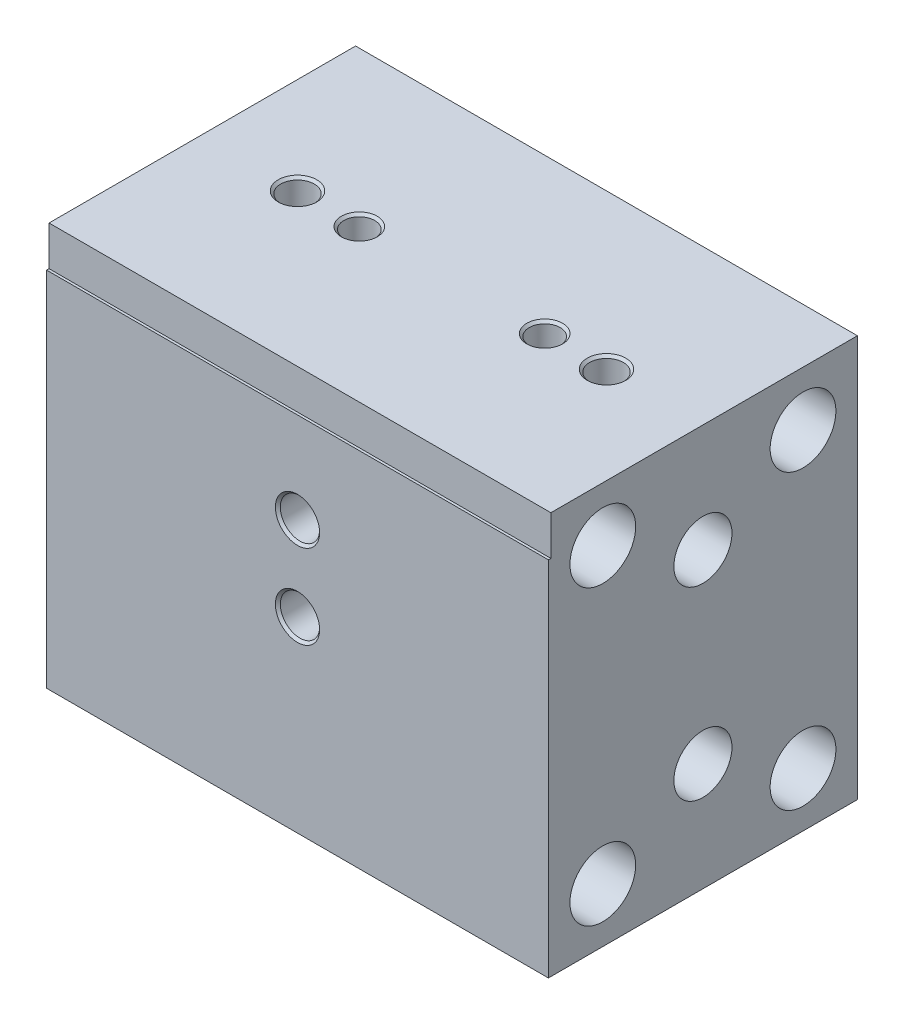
ISO-10303-21;
HEADER;
FILE_DESCRIPTION(('STEP AP214'),'2;1');
FILE_NAME('part.step','',(''),(''),'','','');
FILE_SCHEMA(('AUTOMOTIVE_DESIGN { 1 0 10303 214 1 1 1 1 }'));
ENDSEC;
DATA;
#1=APPLICATION_CONTEXT('core data for automotive mechanical design processes');
#2=APPLICATION_PROTOCOL_DEFINITION('international standard','automotive_design',2000,#1);
#3=PRODUCT_CONTEXT('',#1,'mechanical');
#4=PRODUCT('Part','Part','',(#3));
#5=PRODUCT_RELATED_PRODUCT_CATEGORY('part','',(#4));
#6=PRODUCT_DEFINITION_FORMATION('','',#4);
#7=PRODUCT_DEFINITION_CONTEXT('part definition',#1,'design');
#8=PRODUCT_DEFINITION('design','',#6,#7);
#9=PRODUCT_DEFINITION_SHAPE('','',#8);
#10=(LENGTH_UNIT() NAMED_UNIT(*) SI_UNIT(.MILLI.,.METRE.));
#11=(NAMED_UNIT(*) PLANE_ANGLE_UNIT() SI_UNIT($,.RADIAN.));
#12=(NAMED_UNIT(*) SI_UNIT($,.STERADIAN.) SOLID_ANGLE_UNIT());
#13=UNCERTAINTY_MEASURE_WITH_UNIT(LENGTH_MEASURE(1.E-05),#10,'distance_accuracy_value','');
#14=(GEOMETRIC_REPRESENTATION_CONTEXT(3) GLOBAL_UNCERTAINTY_ASSIGNED_CONTEXT((#13)) GLOBAL_UNIT_ASSIGNED_CONTEXT((#10,
#11,#12)) REPRESENTATION_CONTEXT('',''));
#15=CARTESIAN_POINT('',(0.,0.,0.));
#16=DIRECTION('',(0.,0.,1.));
#17=DIRECTION('',(1.,0.,0.));
#18=AXIS2_PLACEMENT_3D('',#15,#16,#17);
#19=CARTESIAN_POINT('',(-25.781,20.6375,15.875));
#20=DIRECTION('',(1.,0.,0.));
#21=DIRECTION('',(0.,1.,0.));
#22=AXIS2_PLACEMENT_3D('',#19,#20,#21);
#23=PLANE('',#22);
#24=CARTESIAN_POINT('',(-25.781,-9.525,0.));
#25=DIRECTION('',(1.,0.,0.));
#26=DIRECTION('',(0.,0.,-1.));
#27=AXIS2_PLACEMENT_3D('',#24,#25,#26);
#28=CIRCLE('',#27,2.9845);
#29=CARTESIAN_POINT('',(-25.781,-9.525,-2.9845));
#30=VERTEX_POINT('',#29);
#31=EDGE_CURVE('E497',#30,#30,#28,.T.);
#32=ORIENTED_EDGE('',*,*,#31,.T.);
#33=EDGE_LOOP('',(#32));
#34=FACE_BOUND('',#33,.T.);
#35=CARTESIAN_POINT('',(-25.781,9.525,0.));
#36=DIRECTION('',(1.,0.,0.));
#37=DIRECTION('',(0.,0.,-1.));
#38=AXIS2_PLACEMENT_3D('',#35,#36,#37);
#39=CIRCLE('',#38,2.9845);
#40=CARTESIAN_POINT('',(-25.781,9.525,-2.9845));
#41=VERTEX_POINT('',#40);
#42=EDGE_CURVE('E130',#41,#41,#39,.T.);
#43=ORIENTED_EDGE('',*,*,#42,.T.);
#44=EDGE_LOOP('',(#43));
#45=FACE_BOUND('',#44,.T.);
#46=CARTESIAN_POINT('',(-25.781,-15.0495,-10.287));
#47=DIRECTION('',(1.,0.,0.));
#48=DIRECTION('',(0.,0.,-1.));
#49=AXIS2_PLACEMENT_3D('',#46,#47,#48);
#50=CIRCLE('',#49,3.3782);
#51=CARTESIAN_POINT('',(-25.781,-15.0495,-13.6652));
#52=VERTEX_POINT('',#51);
#53=EDGE_CURVE('E155',#52,#52,#50,.T.);
#54=ORIENTED_EDGE('',*,*,#53,.T.);
#55=EDGE_LOOP('',(#54));
#56=FACE_BOUND('',#55,.T.);
#57=CARTESIAN_POINT('',(-25.781,-15.0495,10.287));
#58=DIRECTION('',(1.,0.,0.));
#59=DIRECTION('',(0.,0.,-1.));
#60=AXIS2_PLACEMENT_3D('',#57,#58,#59);
#61=CIRCLE('',#60,3.3782);
#62=CARTESIAN_POINT('',(-25.781,-15.0495,6.9088));
#63=VERTEX_POINT('',#62);
#64=EDGE_CURVE('E392',#63,#63,#61,.T.);
#65=ORIENTED_EDGE('',*,*,#64,.T.);
#66=EDGE_LOOP('',(#65));
#67=FACE_BOUND('',#66,.T.);
#68=CARTESIAN_POINT('',(-25.781,15.0495,-10.287));
#69=DIRECTION('',(1.,0.,0.));
#70=DIRECTION('',(0.,0.,-1.));
#71=AXIS2_PLACEMENT_3D('',#68,#69,#70);
#72=CIRCLE('',#71,3.3782);
#73=CARTESIAN_POINT('',(-25.781,15.0495,-13.6652));
#74=VERTEX_POINT('',#73);
#75=EDGE_CURVE('E387',#74,#74,#72,.T.);
#76=ORIENTED_EDGE('',*,*,#75,.T.);
#77=EDGE_LOOP('',(#76));
#78=FACE_BOUND('',#77,.T.);
#79=CARTESIAN_POINT('',(-25.781,15.0495,10.287));
#80=DIRECTION('',(1.,0.,0.));
#81=DIRECTION('',(0.,0.,-1.));
#82=AXIS2_PLACEMENT_3D('',#79,#80,#81);
#83=CIRCLE('',#82,3.3782);
#84=CARTESIAN_POINT('',(-25.781,15.0495,6.9088));
#85=VERTEX_POINT('',#84);
#86=EDGE_CURVE('E379',#85,#85,#83,.T.);
#87=ORIENTED_EDGE('',*,*,#86,.T.);
#88=EDGE_LOOP('',(#87));
#89=FACE_BOUND('',#88,.T.);
#90=DIRECTION('',(0.,0.,-1.));
#91=VECTOR('',#90,1.);
#92=CARTESIAN_POINT('',(-25.781,16.5735,15.875));
#93=LINE('',#92,#91);
#94=CARTESIAN_POINT('',(-25.781,16.5735,15.875));
#95=VERTEX_POINT('',#94);
#96=CARTESIAN_POINT('',(-25.781,16.5735,15.621));
#97=VERTEX_POINT('',#96);
#98=EDGE_CURVE('E52',#95,#97,#93,.T.);
#99=ORIENTED_EDGE('',*,*,#98,.T.);
#100=DIRECTION('',(0.,1.,0.));
#101=VECTOR('',#100,1.);
#102=CARTESIAN_POINT('',(-25.781,16.5735,15.621));
#103=LINE('',#102,#101);
#104=CARTESIAN_POINT('',(-25.781,20.6375,15.621));
#105=VERTEX_POINT('',#104);
#106=EDGE_CURVE('E87',#97,#105,#103,.T.);
#107=ORIENTED_EDGE('',*,*,#106,.T.);
#108=DIRECTION('',(0.,0.,-1.));
#109=VECTOR('',#108,1.);
#110=CARTESIAN_POINT('',(-25.781,20.6375,15.875));
#111=LINE('',#110,#109);
#112=CARTESIAN_POINT('',(-25.781,20.6375,-15.875));
#113=VERTEX_POINT('',#112);
#114=EDGE_CURVE('E81',#105,#113,#111,.T.);
#115=ORIENTED_EDGE('',*,*,#114,.T.);
#116=DIRECTION('',(0.,-1.,0.));
#117=VECTOR('',#116,1.);
#118=CARTESIAN_POINT('',(-25.781,20.6375,-15.875));
#119=LINE('',#118,#117);
#120=CARTESIAN_POINT('',(-25.781,-20.6375,-15.875));
#121=VERTEX_POINT('',#120);
#122=EDGE_CURVE('E85',#113,#121,#119,.T.);
#123=ORIENTED_EDGE('',*,*,#122,.T.);
#124=DIRECTION('',(0.,0.,-1.));
#125=VECTOR('',#124,1.);
#126=CARTESIAN_POINT('',(-25.781,-20.6375,15.875));
#127=LINE('',#126,#125);
#128=CARTESIAN_POINT('',(-25.781,-20.6375,15.875));
#129=VERTEX_POINT('',#128);
#130=EDGE_CURVE('E119',#129,#121,#127,.T.);
#131=ORIENTED_EDGE('',*,*,#130,.F.);
#132=DIRECTION('',(0.,-1.,0.));
#133=VECTOR('',#132,1.);
#134=CARTESIAN_POINT('',(-25.781,20.6375,15.875));
#135=LINE('',#134,#133);
#136=EDGE_CURVE('E100',#95,#129,#135,.T.);
#137=ORIENTED_EDGE('',*,*,#136,.F.);
#138=EDGE_LOOP('',(#99,#107,#115,#123,#131,#137));
#139=FACE_BOUND('',#138,.T.);
#140=ADVANCED_FACE('F37',(#34,#45,#56,#67,#78,#89,#139),#23,.F.);
#141=CARTESIAN_POINT('',(-25.781,-20.6375,15.875));
#142=DIRECTION('',(0.,1.,0.));
#143=DIRECTION('',(0.,0.,1.));
#144=AXIS2_PLACEMENT_3D('',#141,#142,#143);
#145=PLANE('',#144);
#146=DIRECTION('',(1.,0.,0.));
#147=VECTOR('',#146,1.);
#148=CARTESIAN_POINT('',(-25.781,-20.6375,-15.875));
#149=LINE('',#148,#147);
#150=CARTESIAN_POINT('',(25.781,-20.6375,-15.875));
#151=VERTEX_POINT('',#150);
#152=EDGE_CURVE('E104',#121,#151,#149,.T.);
#153=ORIENTED_EDGE('',*,*,#152,.T.);
#154=DIRECTION('',(0.,0.,-1.));
#155=VECTOR('',#154,1.);
#156=CARTESIAN_POINT('',(25.781,-20.6375,15.875));
#157=LINE('',#156,#155);
#158=CARTESIAN_POINT('',(25.781,-20.6375,15.875));
#159=VERTEX_POINT('',#158);
#160=EDGE_CURVE('E116',#159,#151,#157,.T.);
#161=ORIENTED_EDGE('',*,*,#160,.F.);
#162=DIRECTION('',(1.,0.,0.));
#163=VECTOR('',#162,1.);
#164=CARTESIAN_POINT('',(-25.781,-20.6375,15.875));
#165=LINE('',#164,#163);
#166=EDGE_CURVE('E61',#129,#159,#165,.T.);
#167=ORIENTED_EDGE('',*,*,#166,.F.);
#168=ORIENTED_EDGE('',*,*,#130,.T.);
#169=EDGE_LOOP('',(#153,#161,#167,#168));
#170=FACE_BOUND('',#169,.T.);
#171=ADVANCED_FACE('F182',(#170),#145,.F.);
#172=CARTESIAN_POINT('',(25.781,-20.6375,15.875));
#173=DIRECTION('',(-1.,0.,0.));
#174=DIRECTION('',(0.,0.,1.));
#175=AXIS2_PLACEMENT_3D('',#172,#173,#174);
#176=PLANE('',#175);
#177=CARTESIAN_POINT('',(25.781,-9.525,0.));
#178=DIRECTION('',(1.,0.,0.));
#179=DIRECTION('',(0.,0.,-1.));
#180=AXIS2_PLACEMENT_3D('',#177,#178,#179);
#181=CIRCLE('',#180,2.9845);
#182=CARTESIAN_POINT('',(25.781,-9.525,-2.9845));
#183=VERTEX_POINT('',#182);
#184=EDGE_CURVE('E499',#183,#183,#181,.T.);
#185=ORIENTED_EDGE('',*,*,#184,.F.);
#186=EDGE_LOOP('',(#185));
#187=FACE_BOUND('',#186,.T.);
#188=CARTESIAN_POINT('',(25.781,9.525,0.));
#189=DIRECTION('',(1.,0.,0.));
#190=DIRECTION('',(0.,0.,-1.));
#191=AXIS2_PLACEMENT_3D('',#188,#189,#190);
#192=CIRCLE('',#191,2.9845);
#193=CARTESIAN_POINT('',(25.781,9.525,-2.9845));
#194=VERTEX_POINT('',#193);
#195=EDGE_CURVE('E153',#194,#194,#192,.T.);
#196=ORIENTED_EDGE('',*,*,#195,.F.);
#197=EDGE_LOOP('',(#196));
#198=FACE_BOUND('',#197,.T.);
#199=CARTESIAN_POINT('',(25.781,-15.0495,-10.287));
#200=DIRECTION('',(1.,0.,0.));
#201=DIRECTION('',(0.,0.,-1.));
#202=AXIS2_PLACEMENT_3D('',#199,#200,#201);
#203=CIRCLE('',#202,3.3782);
#204=CARTESIAN_POINT('',(25.781,-15.0495,-13.6652));
#205=VERTEX_POINT('',#204);
#206=EDGE_CURVE('E152',#205,#205,#203,.T.);
#207=ORIENTED_EDGE('',*,*,#206,.F.);
#208=EDGE_LOOP('',(#207));
#209=FACE_BOUND('',#208,.T.);
#210=CARTESIAN_POINT('',(25.781,-15.0495,10.287));
#211=DIRECTION('',(1.,0.,0.));
#212=DIRECTION('',(0.,0.,-1.));
#213=AXIS2_PLACEMENT_3D('',#210,#211,#212);
#214=CIRCLE('',#213,3.3782);
#215=CARTESIAN_POINT('',(25.781,-15.0495,6.9088));
#216=VERTEX_POINT('',#215);
#217=EDGE_CURVE('E395',#216,#216,#214,.T.);
#218=ORIENTED_EDGE('',*,*,#217,.F.);
#219=EDGE_LOOP('',(#218));
#220=FACE_BOUND('',#219,.T.);
#221=CARTESIAN_POINT('',(25.781,15.0495,-10.287));
#222=DIRECTION('',(1.,0.,0.));
#223=DIRECTION('',(0.,0.,-1.));
#224=AXIS2_PLACEMENT_3D('',#221,#222,#223);
#225=CIRCLE('',#224,3.3782);
#226=CARTESIAN_POINT('',(25.781,15.0495,-13.6652));
#227=VERTEX_POINT('',#226);
#228=EDGE_CURVE('E389',#227,#227,#225,.T.);
#229=ORIENTED_EDGE('',*,*,#228,.F.);
#230=EDGE_LOOP('',(#229));
#231=FACE_BOUND('',#230,.T.);
#232=CARTESIAN_POINT('',(25.781,15.0495,10.287));
#233=DIRECTION('',(1.,0.,0.));
#234=DIRECTION('',(0.,0.,-1.));
#235=AXIS2_PLACEMENT_3D('',#232,#233,#234);
#236=CIRCLE('',#235,3.3782);
#237=CARTESIAN_POINT('',(25.781,15.0495,6.9088));
#238=VERTEX_POINT('',#237);
#239=EDGE_CURVE('E383',#238,#238,#236,.T.);
#240=ORIENTED_EDGE('',*,*,#239,.F.);
#241=EDGE_LOOP('',(#240));
#242=FACE_BOUND('',#241,.T.);
#243=DIRECTION('',(0.,0.,-1.));
#244=VECTOR('',#243,1.);
#245=CARTESIAN_POINT('',(25.781,20.6375,15.875));
#246=LINE('',#245,#244);
#247=CARTESIAN_POINT('',(25.781,20.6375,15.621));
#248=VERTEX_POINT('',#247);
#249=CARTESIAN_POINT('',(25.781,20.6375,-15.875));
#250=VERTEX_POINT('',#249);
#251=EDGE_CURVE('E90',#248,#250,#246,.T.);
#252=ORIENTED_EDGE('',*,*,#251,.F.);
#253=DIRECTION('',(0.,1.,0.));
#254=VECTOR('',#253,1.);
#255=CARTESIAN_POINT('',(25.781,16.5735,15.621));
#256=LINE('',#255,#254);
#257=CARTESIAN_POINT('',(25.781,16.5735,15.621));
#258=VERTEX_POINT('',#257);
#259=EDGE_CURVE('E320',#258,#248,#256,.T.);
#260=ORIENTED_EDGE('',*,*,#259,.F.);
#261=DIRECTION('',(0.,0.,-1.));
#262=VECTOR('',#261,1.);
#263=CARTESIAN_POINT('',(25.781,16.5735,15.875));
#264=LINE('',#263,#262);
#265=CARTESIAN_POINT('',(25.781,16.5735,15.875));
#266=VERTEX_POINT('',#265);
#267=EDGE_CURVE('E318',#266,#258,#264,.T.);
#268=ORIENTED_EDGE('',*,*,#267,.F.);
#269=DIRECTION('',(0.,1.,0.));
#270=VECTOR('',#269,1.);
#271=CARTESIAN_POINT('',(25.781,-20.6375,15.875));
#272=LINE('',#271,#270);
#273=EDGE_CURVE('E91',#159,#266,#272,.T.);
#274=ORIENTED_EDGE('',*,*,#273,.F.);
#275=ORIENTED_EDGE('',*,*,#160,.T.);
#276=DIRECTION('',(0.,1.,0.));
#277=VECTOR('',#276,1.);
#278=CARTESIAN_POINT('',(25.781,-20.6375,-15.875));
#279=LINE('',#278,#277);
#280=EDGE_CURVE('E101',#151,#250,#279,.T.);
#281=ORIENTED_EDGE('',*,*,#280,.T.);
#282=EDGE_LOOP('',(#252,#260,#268,#274,#275,#281));
#283=FACE_BOUND('',#282,.T.);
#284=ADVANCED_FACE('F178',(#187,#198,#209,#220,#231,#242,#283),#176,.F.);
#285=CARTESIAN_POINT('',(25.781,20.6375,15.875));
#286=DIRECTION('',(0.,-1.,0.));
#287=DIRECTION('',(1.,0.,0.));
#288=AXIS2_PLACEMENT_3D('',#285,#286,#287);
#289=PLANE('',#288);
#290=CARTESIAN_POINT('',(15.875,20.6375,0.));
#291=DIRECTION('',(0.,-1.,0.));
#292=DIRECTION('',(1.,0.,0.));
#293=AXIS2_PLACEMENT_3D('',#290,#291,#292);
#294=CIRCLE('',#293,1.9812);
#295=CARTESIAN_POINT('',(17.8562,20.6375,0.));
#296=VERTEX_POINT('',#295);
#297=EDGE_CURVE('E237',#296,#296,#294,.T.);
#298=ORIENTED_EDGE('',*,*,#297,.T.);
#299=EDGE_LOOP('',(#298));
#300=FACE_BOUND('',#299,.T.);
#301=CARTESIAN_POINT('',(9.525,20.6375,0.));
#302=DIRECTION('',(0.,-1.,0.));
#303=DIRECTION('',(1.,0.,0.));
#304=AXIS2_PLACEMENT_3D('',#301,#302,#303);
#305=CIRCLE('',#304,1.84150000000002);
#306=CARTESIAN_POINT('',(11.3665,20.6375,0.));
#307=VERTEX_POINT('',#306);
#308=EDGE_CURVE('E242',#307,#307,#305,.T.);
#309=ORIENTED_EDGE('',*,*,#308,.T.);
#310=EDGE_LOOP('',(#309));
#311=FACE_BOUND('',#310,.T.);
#312=CARTESIAN_POINT('',(-9.525,20.6375,0.));
#313=DIRECTION('',(0.,-1.,0.));
#314=DIRECTION('',(1.,0.,0.));
#315=AXIS2_PLACEMENT_3D('',#312,#313,#314);
#316=CIRCLE('',#315,1.84150000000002);
#317=CARTESIAN_POINT('',(-7.68349999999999,20.6375,0.));
#318=VERTEX_POINT('',#317);
#319=EDGE_CURVE('E231',#318,#318,#316,.T.);
#320=ORIENTED_EDGE('',*,*,#319,.T.);
#321=EDGE_LOOP('',(#320));
#322=FACE_BOUND('',#321,.T.);
#323=CARTESIAN_POINT('',(-15.875,20.6375,0.));
#324=DIRECTION('',(0.,-1.,0.));
#325=DIRECTION('',(1.,0.,0.));
#326=AXIS2_PLACEMENT_3D('',#323,#324,#325);
#327=CIRCLE('',#326,1.98119999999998);
#328=CARTESIAN_POINT('',(-13.8938,20.6375,0.));
#329=VERTEX_POINT('',#328);
#330=EDGE_CURVE('E246',#329,#329,#327,.T.);
#331=ORIENTED_EDGE('',*,*,#330,.T.);
#332=EDGE_LOOP('',(#331));
#333=FACE_BOUND('',#332,.T.);
#334=ORIENTED_EDGE('',*,*,#114,.F.);
#335=DIRECTION('',(1.,0.,0.));
#336=VECTOR('',#335,1.);
#337=CARTESIAN_POINT('',(-25.781,20.6375,15.621));
#338=LINE('',#337,#336);
#339=EDGE_CURVE('E106',#105,#248,#338,.T.);
#340=ORIENTED_EDGE('',*,*,#339,.T.);
#341=ORIENTED_EDGE('',*,*,#251,.T.);
#342=DIRECTION('',(-1.,0.,0.));
#343=VECTOR('',#342,1.);
#344=CARTESIAN_POINT('',(25.781,20.6375,-15.875));
#345=LINE('',#344,#343);
#346=EDGE_CURVE('E94',#250,#113,#345,.T.);
#347=ORIENTED_EDGE('',*,*,#346,.T.);
#348=EDGE_LOOP('',(#334,#340,#341,#347));
#349=FACE_BOUND('',#348,.T.);
#350=ADVANCED_FACE('F95',(#300,#311,#322,#333,#349),#289,.F.);
#351=CARTESIAN_POINT('',(-25.781,20.6375,15.875));
#352=DIRECTION('',(0.,0.,-1.));
#353=DIRECTION('',(-1.,0.,0.));
#354=AXIS2_PLACEMENT_3D('',#351,#352,#353);
#355=PLANE('',#354);
#356=CARTESIAN_POINT('',(0.,-1.397,15.875));
#357=DIRECTION('',(0.,0.,-1.));
#358=DIRECTION('',(-1.,0.,0.));
#359=AXIS2_PLACEMENT_3D('',#356,#357,#358);
#360=CIRCLE('',#359,2.27329999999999);
#361=CARTESIAN_POINT('',(-2.27329999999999,-1.397,15.875));
#362=VERTEX_POINT('',#361);
#363=EDGE_CURVE('E255',#362,#362,#360,.T.);
#364=ORIENTED_EDGE('',*,*,#363,.T.);
#365=EDGE_LOOP('',(#364));
#366=FACE_BOUND('',#365,.T.);
#367=CARTESIAN_POINT('',(0.,7.239,15.875));
#368=DIRECTION('',(0.,0.,-1.));
#369=DIRECTION('',(-1.,0.,0.));
#370=AXIS2_PLACEMENT_3D('',#367,#368,#369);
#371=CIRCLE('',#370,2.27329999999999);
#372=CARTESIAN_POINT('',(-2.27329999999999,7.239,15.875));
#373=VERTEX_POINT('',#372);
#374=EDGE_CURVE('E258',#373,#373,#371,.T.);
#375=ORIENTED_EDGE('',*,*,#374,.T.);
#376=EDGE_LOOP('',(#375));
#377=FACE_BOUND('',#376,.T.);
#378=ORIENTED_EDGE('',*,*,#273,.T.);
#379=DIRECTION('',(1.,0.,0.));
#380=VECTOR('',#379,1.);
#381=CARTESIAN_POINT('',(-25.781,16.5735,15.875));
#382=LINE('',#381,#380);
#383=EDGE_CURVE('E322',#95,#266,#382,.T.);
#384=ORIENTED_EDGE('',*,*,#383,.F.);
#385=ORIENTED_EDGE('',*,*,#136,.T.);
#386=ORIENTED_EDGE('',*,*,#166,.T.);
#387=EDGE_LOOP('',(#378,#384,#385,#386));
#388=FACE_BOUND('',#387,.T.);
#389=ADVANCED_FACE('F169',(#366,#377,#388),#355,.F.);
#390=CARTESIAN_POINT('',(-25.781,20.6375,-15.875));
#391=DIRECTION('',(0.,0.,-1.));
#392=DIRECTION('',(-1.,0.,0.));
#393=AXIS2_PLACEMENT_3D('',#390,#391,#392);
#394=PLANE('',#393);
#395=CARTESIAN_POINT('',(-15.875,0.,-15.875));
#396=DIRECTION('',(0.,0.,-1.));
#397=DIRECTION('',(-1.,0.,0.));
#398=AXIS2_PLACEMENT_3D('',#395,#396,#397);
#399=CIRCLE('',#398,1.9812);
#400=CARTESIAN_POINT('',(-17.8562,0.,-15.875));
#401=VERTEX_POINT('',#400);
#402=EDGE_CURVE('E273',#401,#401,#399,.F.);
#403=ORIENTED_EDGE('',*,*,#402,.T.);
#404=EDGE_LOOP('',(#403));
#405=FACE_BOUND('',#404,.T.);
#406=CARTESIAN_POINT('',(-9.525,0.,-15.875));
#407=DIRECTION('',(0.,0.,-1.));
#408=DIRECTION('',(-1.,0.,0.));
#409=AXIS2_PLACEMENT_3D('',#406,#407,#408);
#410=CIRCLE('',#409,1.8415);
#411=CARTESIAN_POINT('',(-11.3665,0.,-15.875));
#412=VERTEX_POINT('',#411);
#413=EDGE_CURVE('E276',#412,#412,#410,.F.);
#414=ORIENTED_EDGE('',*,*,#413,.T.);
#415=EDGE_LOOP('',(#414));
#416=FACE_BOUND('',#415,.T.);
#417=CARTESIAN_POINT('',(9.525,0.,-15.875));
#418=DIRECTION('',(0.,0.,-1.));
#419=DIRECTION('',(-1.,0.,0.));
#420=AXIS2_PLACEMENT_3D('',#417,#418,#419);
#421=CIRCLE('',#420,1.84150000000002);
#422=CARTESIAN_POINT('',(7.68349999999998,0.,-15.875));
#423=VERTEX_POINT('',#422);
#424=EDGE_CURVE('E279',#423,#423,#421,.F.);
#425=ORIENTED_EDGE('',*,*,#424,.T.);
#426=EDGE_LOOP('',(#425));
#427=FACE_BOUND('',#426,.T.);
#428=CARTESIAN_POINT('',(15.875,0.,-15.875));
#429=DIRECTION('',(0.,0.,-1.));
#430=DIRECTION('',(-1.,0.,0.));
#431=AXIS2_PLACEMENT_3D('',#428,#429,#430);
#432=CIRCLE('',#431,1.9812);
#433=CARTESIAN_POINT('',(13.8938,0.,-15.875));
#434=VERTEX_POINT('',#433);
#435=EDGE_CURVE('E281',#434,#434,#432,.F.);
#436=ORIENTED_EDGE('',*,*,#435,.T.);
#437=EDGE_LOOP('',(#436));
#438=FACE_BOUND('',#437,.T.);
#439=ORIENTED_EDGE('',*,*,#122,.F.);
#440=ORIENTED_EDGE('',*,*,#346,.F.);
#441=ORIENTED_EDGE('',*,*,#280,.F.);
#442=ORIENTED_EDGE('',*,*,#152,.F.);
#443=EDGE_LOOP('',(#439,#440,#441,#442));
#444=FACE_BOUND('',#443,.T.);
#445=ADVANCED_FACE('F103',(#405,#416,#427,#438,#444),#394,.T.);
#446=CARTESIAN_POINT('',(-25.781,16.5735,15.621));
#447=DIRECTION('',(0.,0.,-1.));
#448=DIRECTION('',(-1.,0.,0.));
#449=AXIS2_PLACEMENT_3D('',#446,#447,#448);
#450=PLANE('',#449);
#451=ORIENTED_EDGE('',*,*,#259,.T.);
#452=ORIENTED_EDGE('',*,*,#339,.F.);
#453=ORIENTED_EDGE('',*,*,#106,.F.);
#454=DIRECTION('',(1.,0.,0.));
#455=VECTOR('',#454,1.);
#456=CARTESIAN_POINT('',(-25.781,16.5735,15.621));
#457=LINE('',#456,#455);
#458=EDGE_CURVE('E109',#97,#258,#457,.T.);
#459=ORIENTED_EDGE('',*,*,#458,.T.);
#460=EDGE_LOOP('',(#451,#452,#453,#459));
#461=FACE_BOUND('',#460,.T.);
#462=ADVANCED_FACE('F163',(#461),#450,.F.);
#463=CARTESIAN_POINT('',(-25.781,16.5735,15.875));
#464=DIRECTION('',(0.,-1.,0.));
#465=DIRECTION('',(0.,0.,-1.));
#466=AXIS2_PLACEMENT_3D('',#463,#464,#465);
#467=PLANE('',#466);
#468=ORIENTED_EDGE('',*,*,#267,.T.);
#469=ORIENTED_EDGE('',*,*,#458,.F.);
#470=ORIENTED_EDGE('',*,*,#98,.F.);
#471=ORIENTED_EDGE('',*,*,#383,.T.);
#472=EDGE_LOOP('',(#468,#469,#470,#471));
#473=FACE_BOUND('',#472,.T.);
#474=ADVANCED_FACE('F161',(#473),#467,.F.);
#475=CARTESIAN_POINT('',(15.875,20.6375,0.));
#476=DIRECTION('',(0.,1.,0.));
#477=DIRECTION('',(0.,0.,1.));
#478=AXIS2_PLACEMENT_3D('',#475,#476,#477);
#479=CYLINDRICAL_SURFACE('',#478,1.7272);
#480=CARTESIAN_POINT('',(15.875,20.3835,0.));
#481=DIRECTION('',(0.,-1.,0.));
#482=DIRECTION('',(0.,0.,-1.));
#483=AXIS2_PLACEMENT_3D('',#480,#481,#482);
#484=CIRCLE('',#483,1.7272);
#485=CARTESIAN_POINT('',(15.875,20.3835,-1.7272));
#486=VERTEX_POINT('',#485);
#487=EDGE_CURVE('E249',#486,#486,#484,.F.);
#488=ORIENTED_EDGE('',*,*,#487,.T.);
#489=EDGE_LOOP('',(#488));
#490=FACE_BOUND('',#489,.T.);
#491=CARTESIAN_POINT('',(15.875,11.9589310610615,1.7272));
#492=CARTESIAN_POINT('',(15.7873615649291,11.9589320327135,1.7271995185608));
#493=CARTESIAN_POINT('',(15.6997191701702,11.9637357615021,1.72048836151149));
#494=CARTESIAN_POINT('',(15.527332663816,11.982135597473,1.69409867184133));
#495=CARTESIAN_POINT('',(15.4425916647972,11.9957408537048,1.67440664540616));
#496=CARTESIAN_POINT('',(15.278843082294,12.0296011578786,1.62330969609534));
#497=CARTESIAN_POINT('',(15.1998014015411,12.0498118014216,1.5919828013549));
#498=CARTESIAN_POINT('',(15.0481321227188,12.0945267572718,1.51875274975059));
#499=CARTESIAN_POINT('',(14.9755065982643,12.1190324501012,1.47684619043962));
#500=CARTESIAN_POINT('',(14.8297304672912,12.1729262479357,1.37812578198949));
#501=CARTESIAN_POINT('',(14.7574459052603,12.2025532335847,1.32016319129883));
#502=CARTESIAN_POINT('',(14.6229150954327,12.2614351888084,1.19333842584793));
#503=CARTESIAN_POINT('',(14.5606756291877,12.2906898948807,1.1244689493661));
#504=CARTESIAN_POINT('',(14.4419744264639,12.3489424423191,0.969577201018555));
#505=CARTESIAN_POINT('',(14.3866782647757,12.3776336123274,0.882535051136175));
#506=CARTESIAN_POINT('',(14.2919214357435,12.4281966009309,0.698407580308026));
#507=CARTESIAN_POINT('',(14.2524473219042,12.4500742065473,0.601330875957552));
#508=CARTESIAN_POINT('',(14.1942359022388,12.482780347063,0.409148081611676));
#509=CARTESIAN_POINT('',(14.1739492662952,12.4944275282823,0.31465409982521));
#510=CARTESIAN_POINT('',(14.1494813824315,12.5085094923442,0.122955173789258));
#511=CARTESIAN_POINT('',(14.1452863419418,12.5109521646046,0.0257526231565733));
#512=CARTESIAN_POINT('',(14.1527714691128,12.5066255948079,-0.156502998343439));
#513=CARTESIAN_POINT('',(14.1626724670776,12.5008886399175,-0.241661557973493));
#514=CARTESIAN_POINT('',(14.1947326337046,12.482557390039,-0.408860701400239));
#515=CARTESIAN_POINT('',(14.2168927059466,12.4699625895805,-0.490901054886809));
#516=CARTESIAN_POINT('',(14.2727307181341,12.4388885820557,-0.650512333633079));
#517=CARTESIAN_POINT('',(14.3065011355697,12.4203622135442,-0.728041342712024));
#518=CARTESIAN_POINT('',(14.3843361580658,12.3789471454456,-0.876453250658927));
#519=CARTESIAN_POINT('',(14.428403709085,12.356057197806,-0.947334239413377));
#520=CARTESIAN_POINT('',(14.5313081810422,12.3048041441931,-1.08914861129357));
#521=CARTESIAN_POINT('',(14.5912595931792,12.2761143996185,-1.15915478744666));
#522=CARTESIAN_POINT('',(14.7213397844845,12.2178734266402,-1.28869275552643));
#523=CARTESIAN_POINT('',(14.7914812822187,12.1883211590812,-1.34821124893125));
#524=CARTESIAN_POINT('',(14.9486216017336,12.1281496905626,-1.4612877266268));
#525=CARTESIAN_POINT('',(15.0366142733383,12.0977376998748,-1.51358736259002));
#526=CARTESIAN_POINT('',(15.2220726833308,12.0434405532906,-1.6023177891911));
#527=CARTESIAN_POINT('',(15.3195210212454,12.0195437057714,-1.63877707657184));
#528=CARTESIAN_POINT('',(15.4976883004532,11.9868304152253,-1.68738823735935));
#529=CARTESIAN_POINT('',(15.5769938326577,11.9757947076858,-1.70322972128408));
#530=CARTESIAN_POINT('',(15.7377030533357,11.9614919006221,-1.72363336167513));
#531=CARTESIAN_POINT('',(15.8191045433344,11.9582169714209,-1.72820688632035));
#532=CARTESIAN_POINT('',(15.9817063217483,11.9599103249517,-1.72581940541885));
#533=CARTESIAN_POINT('',(16.0629064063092,11.9648849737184,-1.71884949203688));
#534=CARTESIAN_POINT('',(16.2227477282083,11.982359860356,-1.69376739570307));
#535=CARTESIAN_POINT('',(16.3013870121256,11.9948657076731,-1.6756469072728));
#536=CARTESIAN_POINT('',(16.4549963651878,12.0259378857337,-1.6289063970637));
#537=CARTESIAN_POINT('',(16.5299251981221,12.0445598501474,-1.6001896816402));
#538=CARTESIAN_POINT('',(16.6741862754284,12.0858458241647,-1.53324919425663));
#539=CARTESIAN_POINT('',(16.7435162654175,12.1085114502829,-1.49502161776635));
#540=CARTESIAN_POINT('',(16.8870866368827,12.1599784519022,-1.40263103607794));
#541=CARTESIAN_POINT('',(16.960157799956,12.1891678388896,-1.34686373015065));
#542=CARTESIAN_POINT('',(17.0966091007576,12.2475988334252,-1.22446002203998));
#543=CARTESIAN_POINT('',(17.1599807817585,12.2768404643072,-1.15781423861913));
#544=CARTESIAN_POINT('',(17.282016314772,12.3357938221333,-1.00693207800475));
#545=CARTESIAN_POINT('',(17.3394487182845,12.3652203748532,-0.921576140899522));
#546=CARTESIAN_POINT('',(17.4388188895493,12.4177096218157,-0.740493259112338));
#547=CARTESIAN_POINT('',(17.4807685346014,12.4407771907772,-0.644774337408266));
#548=CARTESIAN_POINT('',(17.5443545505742,12.4762925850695,-0.453642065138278));
#549=CARTESIAN_POINT('',(17.5673440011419,12.4894405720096,-0.358813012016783));
#550=CARTESIAN_POINT('',(17.5969801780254,12.5064564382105,-0.165848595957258));
#551=CARTESIAN_POINT('',(17.6036423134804,12.5103330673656,-0.0677164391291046));
#552=CARTESIAN_POINT('',(17.6004360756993,12.5084806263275,0.116268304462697));
#553=CARTESIAN_POINT('',(17.5924662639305,12.5038547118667,0.202173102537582));
#554=CARTESIAN_POINT('',(17.5640192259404,12.487544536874,0.371181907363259));
#555=CARTESIAN_POINT('',(17.5435414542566,12.4758599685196,0.454285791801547));
#556=CARTESIAN_POINT('',(17.4910744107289,12.4465145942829,0.615376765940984));
#557=CARTESIAN_POINT('',(17.4591139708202,12.4288687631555,0.693376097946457));
#558=CARTESIAN_POINT('',(17.3848281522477,12.3890216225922,0.842983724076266));
#559=CARTESIAN_POINT('',(17.3425000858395,12.3668191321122,0.914590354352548));
#560=CARTESIAN_POINT('',(17.2434291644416,12.3168790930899,1.05783642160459));
#561=CARTESIAN_POINT('',(17.1856132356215,12.2888013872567,1.12861420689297));
#562=CARTESIAN_POINT('',(17.0598318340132,12.2314205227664,1.26003254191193));
#563=CARTESIAN_POINT('',(16.9918543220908,12.2021159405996,1.32066088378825));
#564=CARTESIAN_POINT('',(16.8387922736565,12.1417593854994,1.43685443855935));
#565=CARTESIAN_POINT('',(16.7526474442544,12.1108721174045,1.49111998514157));
#566=CARTESIAN_POINT('',(16.5706673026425,12.0549270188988,1.58419465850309));
#567=CARTESIAN_POINT('',(16.4748457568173,12.0298610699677,1.62302536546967));
#568=CARTESIAN_POINT('',(16.2952717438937,11.9937046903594,1.67737632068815));
#569=CARTESIAN_POINT('',(16.2128104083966,11.9808420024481,1.695965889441));
#570=CARTESIAN_POINT('',(16.045231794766,11.9634596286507,1.72087073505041));
#571=CARTESIAN_POINT('',(15.9601177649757,11.9589301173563,1.72720046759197));
#572=CARTESIAN_POINT('',(15.875,11.9589310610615,1.7272));
#573=B_SPLINE_CURVE_WITH_KNOTS('',3,(#491,#492,#493,#494,#495,#496,#497,#498,#499,#500,#501,
#502,#503,#504,#505,#506,#507,#508,#509,#510,#511,#512,#513,#514,#515,#516,#517,#518,#519,#520,
#521,#522,#523,#524,#525,#526,#527,#528,#529,#530,#531,#532,#533,#534,#535,#536,#537,#538,#539,
#540,#541,#542,#543,#544,#545,#546,#547,#548,#549,#550,#551,#552,#553,#554,#555,#556,#557,#558,
#559,#560,#561,#562,#563,#564,#565,#566,#567,#568,#569,#570,#571,#572),.UNSPECIFIED.,.T.,.F.,(4,
2,2,2,2,2,2,2,2,2,2,2,2,2,2,2,2,2,2,2,2,2,2,2,2,2,2,2,2,2,2,2,2,2,2,2,2,2,2,2,4),(0.,
0.262559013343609,0.525391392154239,0.786492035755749,1.04767675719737,1.33834284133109,
1.62920434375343,1.94859630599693,2.26771625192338,2.55805080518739,2.84813644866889,
3.10468711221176,3.36125668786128,3.61991911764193,3.87865564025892,4.1670804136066,
4.4558683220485,4.77460669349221,5.0927692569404,5.33656772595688,5.58012012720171,
5.82386056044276,6.06778276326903,6.31398821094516,6.56029230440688,6.8484726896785,
7.13690291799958,7.4562294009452,7.77531040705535,8.06894708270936,8.36230652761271,
8.6202498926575,8.87820450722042,9.13551589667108,9.39289406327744,9.67856450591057,
9.9645761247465,10.2821905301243,10.5993592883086,10.8546677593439,11.1096750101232),.UNSPECIFIED.);
#574=CARTESIAN_POINT('',(15.875,11.9589310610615,1.7272));
#575=VERTEX_POINT('',#574);
#576=EDGE_CURVE('E129',#575,#575,#573,.T.);
#577=ORIENTED_EDGE('',*,*,#576,.T.);
#578=EDGE_LOOP('',(#577));
#579=FACE_BOUND('',#578,.T.);
#580=ADVANCED_FACE('F157',(#490,#579),#479,.F.);
#581=CARTESIAN_POINT('',(-15.875,20.6375,0.));
#582=DIRECTION('',(0.,1.,0.));
#583=DIRECTION('',(0.,0.,1.));
#584=AXIS2_PLACEMENT_3D('',#581,#582,#583);
#585=CYLINDRICAL_SURFACE('',#584,1.7272);
#586=CARTESIAN_POINT('',(-15.875,20.3835,0.));
#587=DIRECTION('',(0.,-1.,0.));
#588=DIRECTION('',(0.,0.,-1.));
#589=AXIS2_PLACEMENT_3D('',#586,#587,#588);
#590=CIRCLE('',#589,1.7272);
#591=CARTESIAN_POINT('',(-15.875,20.3835,-1.7272));
#592=VERTEX_POINT('',#591);
#593=EDGE_CURVE('E11',#592,#592,#590,.F.);
#594=ORIENTED_EDGE('',*,*,#593,.T.);
#595=EDGE_LOOP('',(#594));
#596=FACE_BOUND('',#595,.T.);
#597=CARTESIAN_POINT('',(-15.875,11.9589310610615,1.7272));
#598=CARTESIAN_POINT('',(-15.9626384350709,11.9589320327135,1.7271995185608));
#599=CARTESIAN_POINT('',(-16.0502808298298,11.9637357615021,1.72048836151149));
#600=CARTESIAN_POINT('',(-16.222667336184,11.982135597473,1.69409867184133));
#601=CARTESIAN_POINT('',(-16.3074083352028,11.9957408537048,1.67440664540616));
#602=CARTESIAN_POINT('',(-16.471156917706,12.0296011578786,1.62330969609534));
#603=CARTESIAN_POINT('',(-16.5501985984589,12.0498118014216,1.5919828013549));
#604=CARTESIAN_POINT('',(-16.7018678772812,12.0945267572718,1.51875274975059));
#605=CARTESIAN_POINT('',(-16.7744934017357,12.1190324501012,1.47684619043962));
#606=CARTESIAN_POINT('',(-16.9202695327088,12.1729262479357,1.37812578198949));
#607=CARTESIAN_POINT('',(-16.9925540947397,12.2025532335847,1.32016319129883));
#608=CARTESIAN_POINT('',(-17.1270849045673,12.2614351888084,1.19333842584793));
#609=CARTESIAN_POINT('',(-17.1893243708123,12.2906898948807,1.1244689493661));
#610=CARTESIAN_POINT('',(-17.3080255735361,12.3489424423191,0.969577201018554));
#611=CARTESIAN_POINT('',(-17.3633217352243,12.3776336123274,0.882535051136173));
#612=CARTESIAN_POINT('',(-17.4580785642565,12.4281966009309,0.698407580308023));
#613=CARTESIAN_POINT('',(-17.4975526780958,12.4500742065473,0.601330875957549));
#614=CARTESIAN_POINT('',(-17.5557640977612,12.482780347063,0.409148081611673));
#615=CARTESIAN_POINT('',(-17.5760507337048,12.4944275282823,0.314654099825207));
#616=CARTESIAN_POINT('',(-17.6005186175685,12.5085094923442,0.122955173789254));
#617=CARTESIAN_POINT('',(-17.6047136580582,12.5109521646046,0.02575262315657));
#618=CARTESIAN_POINT('',(-17.5972285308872,12.5066255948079,-0.156502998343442));
#619=CARTESIAN_POINT('',(-17.5873275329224,12.5008886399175,-0.241661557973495));
#620=CARTESIAN_POINT('',(-17.5552673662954,12.482557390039,-0.408860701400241));
#621=CARTESIAN_POINT('',(-17.5331072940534,12.4699625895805,-0.490901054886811));
#622=CARTESIAN_POINT('',(-17.4772692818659,12.4388885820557,-0.650512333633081));
#623=CARTESIAN_POINT('',(-17.4434988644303,12.4203622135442,-0.728041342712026));
#624=CARTESIAN_POINT('',(-17.3656638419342,12.3789471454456,-0.876453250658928));
#625=CARTESIAN_POINT('',(-17.321596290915,12.356057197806,-0.947334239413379));
#626=CARTESIAN_POINT('',(-17.2186918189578,12.3048041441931,-1.08914861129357));
#627=CARTESIAN_POINT('',(-17.1587404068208,12.2761143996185,-1.15915478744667));
#628=CARTESIAN_POINT('',(-17.0286602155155,12.2178734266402,-1.28869275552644));
#629=CARTESIAN_POINT('',(-16.9585187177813,12.1883211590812,-1.34821124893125));
#630=CARTESIAN_POINT('',(-16.8013783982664,12.1281496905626,-1.4612877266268));
#631=CARTESIAN_POINT('',(-16.7133857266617,12.0977376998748,-1.51358736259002));
#632=CARTESIAN_POINT('',(-16.5279273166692,12.0434405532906,-1.60231778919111));
#633=CARTESIAN_POINT('',(-16.4304789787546,12.0195437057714,-1.63877707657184));
#634=CARTESIAN_POINT('',(-16.2523116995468,11.9868304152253,-1.68738823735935));
#635=CARTESIAN_POINT('',(-16.1730061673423,11.9757947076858,-1.70322972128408));
#636=CARTESIAN_POINT('',(-16.0122969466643,11.9614919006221,-1.72363336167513));
#637=CARTESIAN_POINT('',(-15.9308954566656,11.9582169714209,-1.72820688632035));
#638=CARTESIAN_POINT('',(-15.7682936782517,11.9599103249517,-1.72581940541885));
#639=CARTESIAN_POINT('',(-15.6870935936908,11.9648849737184,-1.71884949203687));
#640=CARTESIAN_POINT('',(-15.5272522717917,11.982359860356,-1.69376739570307));
#641=CARTESIAN_POINT('',(-15.4486129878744,11.9948657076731,-1.6756469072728));
#642=CARTESIAN_POINT('',(-15.2950036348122,12.0259378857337,-1.62890639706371));
#643=CARTESIAN_POINT('',(-15.2200748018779,12.0445598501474,-1.6001896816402));
#644=CARTESIAN_POINT('',(-15.0758137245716,12.0858458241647,-1.53324919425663));
#645=CARTESIAN_POINT('',(-15.0064837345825,12.1085114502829,-1.49502161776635));
#646=CARTESIAN_POINT('',(-14.8629133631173,12.1599784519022,-1.40263103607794));
#647=CARTESIAN_POINT('',(-14.789842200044,12.1891678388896,-1.34686373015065));
#648=CARTESIAN_POINT('',(-14.6533908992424,12.2475988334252,-1.22446002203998));
#649=CARTESIAN_POINT('',(-14.5900192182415,12.2768404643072,-1.15781423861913));
#650=CARTESIAN_POINT('',(-14.467983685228,12.3357938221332,-1.00693207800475));
#651=CARTESIAN_POINT('',(-14.4105512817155,12.3652203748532,-0.921576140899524));
#652=CARTESIAN_POINT('',(-14.3111811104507,12.4177096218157,-0.740493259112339));
#653=CARTESIAN_POINT('',(-14.2692314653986,12.4407771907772,-0.644774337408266));
#654=CARTESIAN_POINT('',(-14.2056454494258,12.4762925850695,-0.453642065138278));
#655=CARTESIAN_POINT('',(-14.1826559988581,12.4894405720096,-0.358813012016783));
#656=CARTESIAN_POINT('',(-14.1530198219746,12.5064564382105,-0.165848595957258));
#657=CARTESIAN_POINT('',(-14.1463576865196,12.5103330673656,-0.0677164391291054));
#658=CARTESIAN_POINT('',(-14.1495639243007,12.5084806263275,0.116268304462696));
#659=CARTESIAN_POINT('',(-14.1575337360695,12.5038547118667,0.20217310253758));
#660=CARTESIAN_POINT('',(-14.1859807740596,12.487544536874,0.371181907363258));
#661=CARTESIAN_POINT('',(-14.2064585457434,12.4758599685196,0.454285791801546));
#662=CARTESIAN_POINT('',(-14.2589255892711,12.4465145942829,0.615376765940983));
#663=CARTESIAN_POINT('',(-14.2908860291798,12.4288687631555,0.693376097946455));
#664=CARTESIAN_POINT('',(-14.3651718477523,12.3890216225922,0.842983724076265));
#665=CARTESIAN_POINT('',(-14.4074999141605,12.3668191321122,0.914590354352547));
#666=CARTESIAN_POINT('',(-14.5065708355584,12.3168790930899,1.05783642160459));
#667=CARTESIAN_POINT('',(-14.5643867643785,12.2888013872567,1.12861420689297));
#668=CARTESIAN_POINT('',(-14.6901681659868,12.2314205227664,1.26003254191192));
#669=CARTESIAN_POINT('',(-14.7581456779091,12.2021159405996,1.32066088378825));
#670=CARTESIAN_POINT('',(-14.9112077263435,12.1417593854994,1.43685443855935));
#671=CARTESIAN_POINT('',(-14.9973525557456,12.1108721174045,1.49111998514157));
#672=CARTESIAN_POINT('',(-15.1793326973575,12.0549270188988,1.58419465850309));
#673=CARTESIAN_POINT('',(-15.2751542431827,12.0298610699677,1.62302536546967));
#674=CARTESIAN_POINT('',(-15.4547282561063,11.9937046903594,1.67737632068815));
#675=CARTESIAN_POINT('',(-15.5371895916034,11.9808420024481,1.695965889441));
#676=CARTESIAN_POINT('',(-15.704768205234,11.9634596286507,1.72087073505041));
#677=CARTESIAN_POINT('',(-15.7898822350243,11.9589301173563,1.72720046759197));
#678=CARTESIAN_POINT('',(-15.875,11.9589310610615,1.7272));
#679=B_SPLINE_CURVE_WITH_KNOTS('',3,(#597,#598,#599,#600,#601,#602,#603,#604,#605,#606,#607,
#608,#609,#610,#611,#612,#613,#614,#615,#616,#617,#618,#619,#620,#621,#622,#623,#624,#625,#626,
#627,#628,#629,#630,#631,#632,#633,#634,#635,#636,#637,#638,#639,#640,#641,#642,#643,#644,#645,
#646,#647,#648,#649,#650,#651,#652,#653,#654,#655,#656,#657,#658,#659,#660,#661,#662,#663,#664,
#665,#666,#667,#668,#669,#670,#671,#672,#673,#674,#675,#676,#677,#678),.UNSPECIFIED.,.T.,.F.,(4,
2,2,2,2,2,2,2,2,2,2,2,2,2,2,2,2,2,2,2,2,2,2,2,2,2,2,2,2,2,2,2,2,2,2,2,2,2,2,2,4),(0.,
0.262559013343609,0.525391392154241,0.786492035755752,1.04767675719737,1.33834284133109,
1.62920434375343,1.94859630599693,2.26771625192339,2.55805080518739,2.84813644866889,
3.10468711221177,3.36125668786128,3.61991911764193,3.87865564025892,4.1670804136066,
4.45586832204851,4.77460669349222,5.0927692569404,5.33656772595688,5.58012012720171,
5.82386056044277,6.06778276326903,6.31398821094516,6.56029230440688,6.8484726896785,
7.13690291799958,7.4562294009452,7.77531040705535,8.06894708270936,8.36230652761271,
8.6202498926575,8.87820450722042,9.13551589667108,9.39289406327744,9.67856450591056,
9.9645761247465,10.2821905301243,10.5993592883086,10.8546677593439,11.1096750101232),.UNSPECIFIED.);
#680=CARTESIAN_POINT('',(-15.875,11.9589310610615,1.7272));
#681=VERTEX_POINT('',#680);
#682=EDGE_CURVE('E122',#681,#681,#679,.T.);
#683=ORIENTED_EDGE('',*,*,#682,.T.);
#684=EDGE_LOOP('',(#683));
#685=FACE_BOUND('',#684,.T.);
#686=ADVANCED_FACE('F132',(#596,#685),#585,.F.);
#687=CARTESIAN_POINT('',(9.525,14.2875,0.));
#688=DIRECTION('',(0.,1.,0.));
#689=DIRECTION('',(0.,0.,1.));
#690=AXIS2_PLACEMENT_3D('',#687,#688,#689);
#691=CONICAL_SURFACE('',#690,1.5875,1.02974425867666);
#692=CARTESIAN_POINT('',(9.525,13.3336337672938,0.));
#693=VERTEX_POINT('',#692);
#694=VERTEX_LOOP('',#693);
#695=FACE_BOUND('',#694,.T.);
#696=CARTESIAN_POINT('',(9.525,14.2875,0.));
#697=DIRECTION('',(0.,1.,0.));
#698=DIRECTION('',(0.,0.,1.));
#699=AXIS2_PLACEMENT_3D('',#696,#697,#698);
#700=CIRCLE('',#699,1.5875);
#701=CARTESIAN_POINT('',(9.525,14.2875,1.5875));
#702=VERTEX_POINT('',#701);
#703=EDGE_CURVE('E315',#702,#702,#700,.T.);
#704=ORIENTED_EDGE('',*,*,#703,.T.);
#705=EDGE_LOOP('',(#704));
#706=FACE_BOUND('',#705,.T.);
#707=ADVANCED_FACE('F471',(#695,#706),#691,.F.);
#708=CARTESIAN_POINT('',(9.525,20.6375,0.));
#709=DIRECTION('',(0.,1.,0.));
#710=DIRECTION('',(0.,0.,1.));
#711=AXIS2_PLACEMENT_3D('',#708,#709,#710);
#712=CYLINDRICAL_SURFACE('',#711,1.5875);
#713=CARTESIAN_POINT('',(9.525,20.3835,0.));
#714=DIRECTION('',(0.,-1.,0.));
#715=DIRECTION('',(0.,0.,-1.));
#716=AXIS2_PLACEMENT_3D('',#713,#714,#715);
#717=CIRCLE('',#716,1.5875);
#718=CARTESIAN_POINT('',(9.525,20.3835,-1.5875));
#719=VERTEX_POINT('',#718);
#720=EDGE_CURVE('E235',#719,#719,#717,.F.);
#721=ORIENTED_EDGE('',*,*,#720,.T.);
#722=EDGE_LOOP('',(#721));
#723=FACE_BOUND('',#722,.T.);
#724=ORIENTED_EDGE('',*,*,#703,.F.);
#725=EDGE_LOOP('',(#724));
#726=FACE_BOUND('',#725,.T.);
#727=ADVANCED_FACE('F468',(#723,#726),#712,.F.);
#728=CARTESIAN_POINT('',(-9.525,14.2875,0.));
#729=DIRECTION('',(0.,1.,0.));
#730=DIRECTION('',(0.,0.,1.));
#731=AXIS2_PLACEMENT_3D('',#728,#729,#730);
#732=CONICAL_SURFACE('',#731,1.5875,1.02974425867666);
#733=CARTESIAN_POINT('',(-9.525,13.3336337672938,0.));
#734=VERTEX_POINT('',#733);
#735=VERTEX_LOOP('',#734);
#736=FACE_BOUND('',#735,.T.);
#737=CARTESIAN_POINT('',(-9.525,14.2875,0.));
#738=DIRECTION('',(0.,1.,0.));
#739=DIRECTION('',(0.,0.,1.));
#740=AXIS2_PLACEMENT_3D('',#737,#738,#739);
#741=CIRCLE('',#740,1.5875);
#742=CARTESIAN_POINT('',(-9.525,14.2875,1.5875));
#743=VERTEX_POINT('',#742);
#744=EDGE_CURVE('E312',#743,#743,#741,.T.);
#745=ORIENTED_EDGE('',*,*,#744,.T.);
#746=EDGE_LOOP('',(#745));
#747=FACE_BOUND('',#746,.T.);
#748=ADVANCED_FACE('F465',(#736,#747),#732,.F.);
#749=CARTESIAN_POINT('',(-9.525,20.6375,0.));
#750=DIRECTION('',(0.,1.,0.));
#751=DIRECTION('',(0.,0.,1.));
#752=AXIS2_PLACEMENT_3D('',#749,#750,#751);
#753=CYLINDRICAL_SURFACE('',#752,1.5875);
#754=CARTESIAN_POINT('',(-9.525,20.3835,0.));
#755=DIRECTION('',(0.,-1.,0.));
#756=DIRECTION('',(0.,0.,-1.));
#757=AXIS2_PLACEMENT_3D('',#754,#755,#756);
#758=CIRCLE('',#757,1.5875);
#759=CARTESIAN_POINT('',(-9.525,20.3835,-1.5875));
#760=VERTEX_POINT('',#759);
#761=EDGE_CURVE('E45',#760,#760,#758,.F.);
#762=ORIENTED_EDGE('',*,*,#761,.T.);
#763=EDGE_LOOP('',(#762));
#764=FACE_BOUND('',#763,.T.);
#765=ORIENTED_EDGE('',*,*,#744,.F.);
#766=EDGE_LOOP('',(#765));
#767=FACE_BOUND('',#766,.T.);
#768=ADVANCED_FACE('F461',(#764,#767),#753,.F.);
#769=CARTESIAN_POINT('',(0.,-1.397,6.3246));
#770=DIRECTION('',(0.,0.,1.));
#771=DIRECTION('',(1.,0.,0.));
#772=AXIS2_PLACEMENT_3D('',#769,#770,#771);
#773=CONICAL_SURFACE('',#772,2.0193,1.02974425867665);
#774=CARTESIAN_POINT('',(0.,-1.397,5.11128215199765));
#775=VERTEX_POINT('',#774);
#776=VERTEX_LOOP('',#775);
#777=FACE_BOUND('',#776,.T.);
#778=CARTESIAN_POINT('',(0.,-1.397,6.3246));
#779=DIRECTION('',(0.,0.,1.));
#780=DIRECTION('',(1.,0.,0.));
#781=AXIS2_PLACEMENT_3D('',#778,#779,#780);
#782=CIRCLE('',#781,2.0193);
#783=CARTESIAN_POINT('',(2.0193,-1.397,6.3246));
#784=VERTEX_POINT('',#783);
#785=EDGE_CURVE('E303',#784,#784,#782,.T.);
#786=ORIENTED_EDGE('',*,*,#785,.T.);
#787=EDGE_LOOP('',(#786));
#788=FACE_BOUND('',#787,.T.);
#789=ADVANCED_FACE('F457',(#777,#788),#773,.F.);
#790=CARTESIAN_POINT('',(0.,-1.397,15.875));
#791=DIRECTION('',(0.,0.,1.));
#792=DIRECTION('',(1.,0.,0.));
#793=AXIS2_PLACEMENT_3D('',#790,#791,#792);
#794=CYLINDRICAL_SURFACE('',#793,2.0193);
#795=CARTESIAN_POINT('',(0.,-1.397,15.621));
#796=DIRECTION('',(0.,0.,-1.));
#797=DIRECTION('',(-1.,0.,0.));
#798=AXIS2_PLACEMENT_3D('',#795,#796,#797);
#799=CIRCLE('',#798,2.0193);
#800=CARTESIAN_POINT('',(-2.01929999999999,-1.397,15.621));
#801=VERTEX_POINT('',#800);
#802=EDGE_CURVE('E261',#801,#801,#799,.F.);
#803=ORIENTED_EDGE('',*,*,#802,.T.);
#804=EDGE_LOOP('',(#803));
#805=FACE_BOUND('',#804,.T.);
#806=ORIENTED_EDGE('',*,*,#785,.F.);
#807=EDGE_LOOP('',(#806));
#808=FACE_BOUND('',#807,.T.);
#809=ADVANCED_FACE('F453',(#805,#808),#794,.F.);
#810=CARTESIAN_POINT('',(0.,7.239,6.3246));
#811=DIRECTION('',(0.,0.,1.));
#812=DIRECTION('',(1.,0.,0.));
#813=AXIS2_PLACEMENT_3D('',#810,#811,#812);
#814=CONICAL_SURFACE('',#813,2.0193,1.02974425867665);
#815=CARTESIAN_POINT('',(0.,7.239,5.11128215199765));
#816=VERTEX_POINT('',#815);
#817=VERTEX_LOOP('',#816);
#818=FACE_BOUND('',#817,.T.);
#819=CARTESIAN_POINT('',(0.,7.239,6.3246));
#820=DIRECTION('',(0.,0.,1.));
#821=DIRECTION('',(1.,0.,0.));
#822=AXIS2_PLACEMENT_3D('',#819,#820,#821);
#823=CIRCLE('',#822,2.0193);
#824=CARTESIAN_POINT('',(2.0193,7.239,6.3246));
#825=VERTEX_POINT('',#824);
#826=EDGE_CURVE('E299',#825,#825,#823,.T.);
#827=ORIENTED_EDGE('',*,*,#826,.T.);
#828=EDGE_LOOP('',(#827));
#829=FACE_BOUND('',#828,.T.);
#830=ADVANCED_FACE('F449',(#818,#829),#814,.F.);
#831=CARTESIAN_POINT('',(0.,7.239,15.875));
#832=DIRECTION('',(0.,0.,1.));
#833=DIRECTION('',(1.,0.,0.));
#834=AXIS2_PLACEMENT_3D('',#831,#832,#833);
#835=CYLINDRICAL_SURFACE('',#834,2.0193);
#836=CARTESIAN_POINT('',(0.,7.239,15.621));
#837=DIRECTION('',(0.,0.,-1.));
#838=DIRECTION('',(-1.,0.,0.));
#839=AXIS2_PLACEMENT_3D('',#836,#837,#838);
#840=CIRCLE('',#839,2.0193);
#841=CARTESIAN_POINT('',(-2.01929999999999,7.239,15.621));
#842=VERTEX_POINT('',#841);
#843=EDGE_CURVE('E252',#842,#842,#840,.F.);
#844=ORIENTED_EDGE('',*,*,#843,.T.);
#845=EDGE_LOOP('',(#844));
#846=FACE_BOUND('',#845,.T.);
#847=ORIENTED_EDGE('',*,*,#826,.F.);
#848=EDGE_LOOP('',(#847));
#849=FACE_BOUND('',#848,.T.);
#850=ADVANCED_FACE('F445',(#846,#849),#835,.F.);
#851=CARTESIAN_POINT('',(-15.875,0.,-5.5626));
#852=DIRECTION('',(0.,0.,-1.));
#853=DIRECTION('',(-1.,0.,0.));
#854=AXIS2_PLACEMENT_3D('',#851,#852,#853);
#855=CONICAL_SURFACE('',#854,1.7272,1.02974425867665);
#856=CARTESIAN_POINT('',(-15.875,0.,-4.5247935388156));
#857=VERTEX_POINT('',#856);
#858=VERTEX_LOOP('',#857);
#859=FACE_BOUND('',#858,.T.);
#860=CARTESIAN_POINT('',(-15.875,0.,-5.5626));
#861=DIRECTION('',(0.,0.,-1.));
#862=DIRECTION('',(-1.,0.,0.));
#863=AXIS2_PLACEMENT_3D('',#860,#861,#862);
#864=CIRCLE('',#863,1.7272);
#865=CARTESIAN_POINT('',(-17.6022,0.,-5.5626));
#866=VERTEX_POINT('',#865);
#867=EDGE_CURVE('E297',#866,#866,#864,.T.);
#868=ORIENTED_EDGE('',*,*,#867,.T.);
#869=EDGE_LOOP('',(#868));
#870=FACE_BOUND('',#869,.T.);
#871=ADVANCED_FACE('F293',(#859,#870),#855,.F.);
#872=CARTESIAN_POINT('',(-15.875,0.,-15.875));
#873=DIRECTION('',(0.,0.,-1.));
#874=DIRECTION('',(-1.,0.,0.));
#875=AXIS2_PLACEMENT_3D('',#872,#873,#874);
#876=CYLINDRICAL_SURFACE('',#875,1.7272);
#877=CARTESIAN_POINT('',(-15.875,0.,-15.621));
#878=DIRECTION('',(0.,0.,-1.));
#879=DIRECTION('',(-1.,0.,0.));
#880=AXIS2_PLACEMENT_3D('',#877,#878,#879);
#881=CIRCLE('',#880,1.7272);
#882=CARTESIAN_POINT('',(-17.6022,0.,-15.621));
#883=VERTEX_POINT('',#882);
#884=EDGE_CURVE('E121',#883,#883,#881,.T.);
#885=ORIENTED_EDGE('',*,*,#884,.T.);
#886=EDGE_LOOP('',(#885));
#887=FACE_BOUND('',#886,.T.);
#888=ORIENTED_EDGE('',*,*,#867,.F.);
#889=EDGE_LOOP('',(#888));
#890=FACE_BOUND('',#889,.T.);
#891=ADVANCED_FACE('F288',(#887,#890),#876,.F.);
#892=CARTESIAN_POINT('',(15.875,0.,-5.5626));
#893=DIRECTION('',(0.,0.,-1.));
#894=DIRECTION('',(-1.,0.,0.));
#895=AXIS2_PLACEMENT_3D('',#892,#893,#894);
#896=CONICAL_SURFACE('',#895,1.7272,1.02974425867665);
#897=CARTESIAN_POINT('',(15.875,0.,-4.5247935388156));
#898=VERTEX_POINT('',#897);
#899=VERTEX_LOOP('',#898);
#900=FACE_BOUND('',#899,.T.);
#901=CARTESIAN_POINT('',(15.875,0.,-5.5626));
#902=DIRECTION('',(0.,0.,-1.));
#903=DIRECTION('',(-1.,0.,0.));
#904=AXIS2_PLACEMENT_3D('',#901,#902,#903);
#905=CIRCLE('',#904,1.7272);
#906=CARTESIAN_POINT('',(14.1478,0.,-5.5626));
#907=VERTEX_POINT('',#906);
#908=EDGE_CURVE('E300',#907,#907,#905,.T.);
#909=ORIENTED_EDGE('',*,*,#908,.T.);
#910=EDGE_LOOP('',(#909));
#911=FACE_BOUND('',#910,.T.);
#912=ADVANCED_FACE('F292',(#900,#911),#896,.F.);
#913=CARTESIAN_POINT('',(15.875,0.,-15.875));
#914=DIRECTION('',(0.,0.,-1.));
#915=DIRECTION('',(-1.,0.,0.));
#916=AXIS2_PLACEMENT_3D('',#913,#914,#915);
#917=CYLINDRICAL_SURFACE('',#916,1.7272);
#918=CARTESIAN_POINT('',(15.875,0.,-15.621));
#919=DIRECTION('',(0.,0.,-1.));
#920=DIRECTION('',(-1.,0.,0.));
#921=AXIS2_PLACEMENT_3D('',#918,#919,#920);
#922=CIRCLE('',#921,1.7272);
#923=CARTESIAN_POINT('',(14.1478,0.,-15.621));
#924=VERTEX_POINT('',#923);
#925=EDGE_CURVE('E264',#924,#924,#922,.T.);
#926=ORIENTED_EDGE('',*,*,#925,.T.);
#927=EDGE_LOOP('',(#926));
#928=FACE_BOUND('',#927,.T.);
#929=ORIENTED_EDGE('',*,*,#908,.F.);
#930=EDGE_LOOP('',(#929));
#931=FACE_BOUND('',#930,.T.);
#932=ADVANCED_FACE('F435',(#928,#931),#917,.F.);
#933=CARTESIAN_POINT('',(-9.525,0.,-9.52500000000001));
#934=DIRECTION('',(0.,0.,-1.));
#935=DIRECTION('',(-1.,0.,0.));
#936=AXIS2_PLACEMENT_3D('',#933,#934,#935);
#937=CONICAL_SURFACE('',#936,1.5875,1.02974425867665);
#938=CARTESIAN_POINT('',(-9.525,0.,-8.57113376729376));
#939=VERTEX_POINT('',#938);
#940=VERTEX_LOOP('',#939);
#941=FACE_BOUND('',#940,.T.);
#942=CARTESIAN_POINT('',(-9.525,0.,-9.52500000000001));
#943=DIRECTION('',(0.,0.,-1.));
#944=DIRECTION('',(-1.,0.,0.));
#945=AXIS2_PLACEMENT_3D('',#942,#943,#944);
#946=CIRCLE('',#945,1.5875);
#947=CARTESIAN_POINT('',(-11.1125,0.,-9.52500000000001));
#948=VERTEX_POINT('',#947);
#949=EDGE_CURVE('E306',#948,#948,#946,.T.);
#950=ORIENTED_EDGE('',*,*,#949,.T.);
#951=EDGE_LOOP('',(#950));
#952=FACE_BOUND('',#951,.T.);
#953=ADVANCED_FACE('F431',(#941,#952),#937,.F.);
#954=CARTESIAN_POINT('',(-9.525,0.,-15.875));
#955=DIRECTION('',(0.,0.,-1.));
#956=DIRECTION('',(-1.,0.,0.));
#957=AXIS2_PLACEMENT_3D('',#954,#955,#956);
#958=CYLINDRICAL_SURFACE('',#957,1.5875);
#959=CARTESIAN_POINT('',(-9.525,0.,-15.621));
#960=DIRECTION('',(0.,0.,-1.));
#961=DIRECTION('',(-1.,0.,0.));
#962=AXIS2_PLACEMENT_3D('',#959,#960,#961);
#963=CIRCLE('',#962,1.5875);
#964=CARTESIAN_POINT('',(-11.1125,0.,-15.621));
#965=VERTEX_POINT('',#964);
#966=EDGE_CURVE('E270',#965,#965,#963,.T.);
#967=ORIENTED_EDGE('',*,*,#966,.T.);
#968=EDGE_LOOP('',(#967));
#969=FACE_BOUND('',#968,.T.);
#970=ORIENTED_EDGE('',*,*,#949,.F.);
#971=EDGE_LOOP('',(#970));
#972=FACE_BOUND('',#971,.T.);
#973=ADVANCED_FACE('F373',(#969,#972),#958,.F.);
#974=CARTESIAN_POINT('',(9.525,0.,-9.52500000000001));
#975=DIRECTION('',(0.,0.,-1.));
#976=DIRECTION('',(-1.,0.,0.));
#977=AXIS2_PLACEMENT_3D('',#974,#975,#976);
#978=CONICAL_SURFACE('',#977,1.5875,1.02974425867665);
#979=CARTESIAN_POINT('',(9.525,0.,-8.57113376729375));
#980=VERTEX_POINT('',#979);
#981=VERTEX_LOOP('',#980);
#982=FACE_BOUND('',#981,.T.);
#983=CARTESIAN_POINT('',(9.525,0.,-9.52500000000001));
#984=DIRECTION('',(0.,0.,-1.));
#985=DIRECTION('',(-1.,0.,0.));
#986=AXIS2_PLACEMENT_3D('',#983,#984,#985);
#987=CIRCLE('',#986,1.5875);
#988=CARTESIAN_POINT('',(7.9375,0.,-9.52500000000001));
#989=VERTEX_POINT('',#988);
#990=EDGE_CURVE('E377',#989,#989,#987,.T.);
#991=ORIENTED_EDGE('',*,*,#990,.T.);
#992=EDGE_LOOP('',(#991));
#993=FACE_BOUND('',#992,.T.);
#994=ADVANCED_FACE('F369',(#982,#993),#978,.F.);
#995=CARTESIAN_POINT('',(9.525,0.,-15.875));
#996=DIRECTION('',(0.,0.,-1.));
#997=DIRECTION('',(-1.,0.,0.));
#998=AXIS2_PLACEMENT_3D('',#995,#996,#997);
#999=CYLINDRICAL_SURFACE('',#998,1.5875);
#1000=CARTESIAN_POINT('',(9.525,0.,-15.621));
#1001=DIRECTION('',(0.,0.,-1.));
#1002=DIRECTION('',(-1.,0.,0.));
#1003=AXIS2_PLACEMENT_3D('',#1000,#1001,#1002);
#1004=CIRCLE('',#1003,1.5875);
#1005=CARTESIAN_POINT('',(7.9375,0.,-15.621));
#1006=VERTEX_POINT('',#1005);
#1007=EDGE_CURVE('E267',#1006,#1006,#1004,.T.);
#1008=ORIENTED_EDGE('',*,*,#1007,.T.);
#1009=EDGE_LOOP('',(#1008));
#1010=FACE_BOUND('',#1009,.T.);
#1011=ORIENTED_EDGE('',*,*,#990,.F.);
#1012=EDGE_LOOP('',(#1011));
#1013=FACE_BOUND('',#1012,.T.);
#1014=ADVANCED_FACE('F372',(#1010,#1013),#999,.F.);
#1015=CARTESIAN_POINT('',(-25.781,15.0495,10.287));
#1016=DIRECTION('',(1.,0.,0.));
#1017=DIRECTION('',(0.,0.,-1.));
#1018=AXIS2_PLACEMENT_3D('',#1015,#1016,#1017);
#1019=CYLINDRICAL_SURFACE('',#1018,3.3782);
#1020=ORIENTED_EDGE('',*,*,#86,.F.);
#1021=EDGE_LOOP('',(#1020));
#1022=FACE_BOUND('',#1021,.T.);
#1023=ORIENTED_EDGE('',*,*,#239,.T.);
#1024=EDGE_LOOP('',(#1023));
#1025=FACE_BOUND('',#1024,.T.);
#1026=ADVANCED_FACE('F417',(#1022,#1025),#1019,.F.);
#1027=CARTESIAN_POINT('',(-25.781,15.0495,-10.287));
#1028=DIRECTION('',(1.,0.,0.));
#1029=DIRECTION('',(0.,0.,-1.));
#1030=AXIS2_PLACEMENT_3D('',#1027,#1028,#1029);
#1031=CYLINDRICAL_SURFACE('',#1030,3.3782);
#1032=ORIENTED_EDGE('',*,*,#75,.F.);
#1033=EDGE_LOOP('',(#1032));
#1034=FACE_BOUND('',#1033,.T.);
#1035=ORIENTED_EDGE('',*,*,#228,.T.);
#1036=EDGE_LOOP('',(#1035));
#1037=FACE_BOUND('',#1036,.T.);
#1038=ADVANCED_FACE('F412',(#1034,#1037),#1031,.F.);
#1039=CARTESIAN_POINT('',(-25.781,-15.0495,10.287));
#1040=DIRECTION('',(1.,0.,0.));
#1041=DIRECTION('',(0.,0.,-1.));
#1042=AXIS2_PLACEMENT_3D('',#1039,#1040,#1041);
#1043=CYLINDRICAL_SURFACE('',#1042,3.3782);
#1044=ORIENTED_EDGE('',*,*,#64,.F.);
#1045=EDGE_LOOP('',(#1044));
#1046=FACE_BOUND('',#1045,.T.);
#1047=ORIENTED_EDGE('',*,*,#217,.T.);
#1048=EDGE_LOOP('',(#1047));
#1049=FACE_BOUND('',#1048,.T.);
#1050=ADVANCED_FACE('F408',(#1046,#1049),#1043,.F.);
#1051=CARTESIAN_POINT('',(-25.781,-15.0495,-10.287));
#1052=DIRECTION('',(1.,0.,0.));
#1053=DIRECTION('',(0.,0.,-1.));
#1054=AXIS2_PLACEMENT_3D('',#1051,#1052,#1053);
#1055=CYLINDRICAL_SURFACE('',#1054,3.3782);
#1056=ORIENTED_EDGE('',*,*,#53,.F.);
#1057=EDGE_LOOP('',(#1056));
#1058=FACE_BOUND('',#1057,.T.);
#1059=ORIENTED_EDGE('',*,*,#206,.T.);
#1060=EDGE_LOOP('',(#1059));
#1061=FACE_BOUND('',#1060,.T.);
#1062=ADVANCED_FACE('F142',(#1058,#1061),#1055,.F.);
#1063=CARTESIAN_POINT('',(-25.781,9.525,0.));
#1064=DIRECTION('',(1.,0.,0.));
#1065=DIRECTION('',(0.,0.,-1.));
#1066=AXIS2_PLACEMENT_3D('',#1063,#1064,#1065);
#1067=CYLINDRICAL_SURFACE('',#1066,2.9845);
#1068=ORIENTED_EDGE('',*,*,#682,.F.);
#1069=EDGE_LOOP('',(#1068));
#1070=FACE_BOUND('',#1069,.T.);
#1071=ORIENTED_EDGE('',*,*,#42,.F.);
#1072=EDGE_LOOP('',(#1071));
#1073=FACE_BOUND('',#1072,.T.);
#1074=ORIENTED_EDGE('',*,*,#195,.T.);
#1075=EDGE_LOOP('',(#1074));
#1076=FACE_BOUND('',#1075,.T.);
#1077=ORIENTED_EDGE('',*,*,#576,.F.);
#1078=EDGE_LOOP('',(#1077));
#1079=FACE_BOUND('',#1078,.T.);
#1080=ADVANCED_FACE('F136',(#1070,#1073,#1076,#1079),#1067,.F.);
#1081=CARTESIAN_POINT('',(-25.781,-9.525,0.));
#1082=DIRECTION('',(1.,0.,0.));
#1083=DIRECTION('',(0.,0.,-1.));
#1084=AXIS2_PLACEMENT_3D('',#1081,#1082,#1083);
#1085=CYLINDRICAL_SURFACE('',#1084,2.9845);
#1086=ORIENTED_EDGE('',*,*,#31,.F.);
#1087=EDGE_LOOP('',(#1086));
#1088=FACE_BOUND('',#1087,.T.);
#1089=ORIENTED_EDGE('',*,*,#184,.T.);
#1090=EDGE_LOOP('',(#1089));
#1091=FACE_BOUND('',#1090,.T.);
#1092=ADVANCED_FACE('F141',(#1088,#1091),#1085,.F.);
#1093=CARTESIAN_POINT('',(-15.875,0.,-15.621));
#1094=DIRECTION('',(0.,0.,-1.));
#1095=DIRECTION('',(-1.,0.,0.));
#1096=AXIS2_PLACEMENT_3D('',#1093,#1094,#1095);
#1097=CONICAL_SURFACE('',#1096,1.7272,0.785398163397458);
#1098=ORIENTED_EDGE('',*,*,#402,.F.);
#1099=EDGE_LOOP('',(#1098));
#1100=FACE_BOUND('',#1099,.T.);
#1101=ORIENTED_EDGE('',*,*,#884,.F.);
#1102=EDGE_LOOP('',(#1101));
#1103=FACE_BOUND('',#1102,.T.);
#1104=ADVANCED_FACE('F190',(#1100,#1103),#1097,.F.);
#1105=CARTESIAN_POINT('',(-9.525,0.,-15.621));
#1106=DIRECTION('',(0.,0.,-1.));
#1107=DIRECTION('',(-1.,0.,0.));
#1108=AXIS2_PLACEMENT_3D('',#1105,#1106,#1107);
#1109=CONICAL_SURFACE('',#1108,1.5875,0.785398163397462);
#1110=ORIENTED_EDGE('',*,*,#413,.F.);
#1111=EDGE_LOOP('',(#1110));
#1112=FACE_BOUND('',#1111,.T.);
#1113=ORIENTED_EDGE('',*,*,#966,.F.);
#1114=EDGE_LOOP('',(#1113));
#1115=FACE_BOUND('',#1114,.T.);
#1116=ADVANCED_FACE('F193',(#1112,#1115),#1109,.F.);
#1117=CARTESIAN_POINT('',(9.525,0.,-15.621));
#1118=DIRECTION('',(0.,0.,-1.));
#1119=DIRECTION('',(-1.,0.,0.));
#1120=AXIS2_PLACEMENT_3D('',#1117,#1118,#1119);
#1121=CONICAL_SURFACE('',#1120,1.5875,0.785398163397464);
#1122=ORIENTED_EDGE('',*,*,#424,.F.);
#1123=EDGE_LOOP('',(#1122));
#1124=FACE_BOUND('',#1123,.T.);
#1125=ORIENTED_EDGE('',*,*,#1007,.F.);
#1126=EDGE_LOOP('',(#1125));
#1127=FACE_BOUND('',#1126,.T.);
#1128=ADVANCED_FACE('F197',(#1124,#1127),#1121,.F.);
#1129=CARTESIAN_POINT('',(15.875,0.,-15.621));
#1130=DIRECTION('',(0.,0.,-1.));
#1131=DIRECTION('',(-1.,0.,0.));
#1132=AXIS2_PLACEMENT_3D('',#1129,#1130,#1131);
#1133=CONICAL_SURFACE('',#1132,1.7272,0.785398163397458);
#1134=ORIENTED_EDGE('',*,*,#435,.F.);
#1135=EDGE_LOOP('',(#1134));
#1136=FACE_BOUND('',#1135,.T.);
#1137=ORIENTED_EDGE('',*,*,#925,.F.);
#1138=EDGE_LOOP('',(#1137));
#1139=FACE_BOUND('',#1138,.T.);
#1140=ADVANCED_FACE('F201',(#1136,#1139),#1133,.F.);
#1141=CARTESIAN_POINT('',(0.,-1.397,15.621));
#1142=DIRECTION('',(0.,0.,1.));
#1143=DIRECTION('',(1.,0.,0.));
#1144=AXIS2_PLACEMENT_3D('',#1141,#1142,#1143);
#1145=CONICAL_SURFACE('',#1144,2.0193,0.785398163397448);
#1146=ORIENTED_EDGE('',*,*,#363,.F.);
#1147=EDGE_LOOP('',(#1146));
#1148=FACE_BOUND('',#1147,.T.);
#1149=ORIENTED_EDGE('',*,*,#802,.F.);
#1150=EDGE_LOOP('',(#1149));
#1151=FACE_BOUND('',#1150,.T.);
#1152=ADVANCED_FACE('F205',(#1148,#1151),#1145,.F.);
#1153=CARTESIAN_POINT('',(0.,7.239,15.621));
#1154=DIRECTION('',(0.,0.,1.));
#1155=DIRECTION('',(1.,0.,0.));
#1156=AXIS2_PLACEMENT_3D('',#1153,#1154,#1155);
#1157=CONICAL_SURFACE('',#1156,2.0193,0.785398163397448);
#1158=ORIENTED_EDGE('',*,*,#374,.F.);
#1159=EDGE_LOOP('',(#1158));
#1160=FACE_BOUND('',#1159,.T.);
#1161=ORIENTED_EDGE('',*,*,#843,.F.);
#1162=EDGE_LOOP('',(#1161));
#1163=FACE_BOUND('',#1162,.T.);
#1164=ADVANCED_FACE('F209',(#1160,#1163),#1157,.F.);
#1165=CARTESIAN_POINT('',(15.875,20.3835,0.));
#1166=DIRECTION('',(0.,1.,0.));
#1167=DIRECTION('',(0.,0.,1.));
#1168=AXIS2_PLACEMENT_3D('',#1165,#1166,#1167);
#1169=CONICAL_SURFACE('',#1168,1.7272,0.785398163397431);
#1170=ORIENTED_EDGE('',*,*,#297,.F.);
#1171=EDGE_LOOP('',(#1170));
#1172=FACE_BOUND('',#1171,.T.);
#1173=ORIENTED_EDGE('',*,*,#487,.F.);
#1174=EDGE_LOOP('',(#1173));
#1175=FACE_BOUND('',#1174,.T.);
#1176=ADVANCED_FACE('F213',(#1172,#1175),#1169,.F.);
#1177=CARTESIAN_POINT('',(9.525,20.3835,0.));
#1178=DIRECTION('',(0.,1.,0.));
#1179=DIRECTION('',(0.,0.,1.));
#1180=AXIS2_PLACEMENT_3D('',#1177,#1178,#1179);
#1181=CONICAL_SURFACE('',#1180,1.5875,0.785398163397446);
#1182=ORIENTED_EDGE('',*,*,#308,.F.);
#1183=EDGE_LOOP('',(#1182));
#1184=FACE_BOUND('',#1183,.T.);
#1185=ORIENTED_EDGE('',*,*,#720,.F.);
#1186=EDGE_LOOP('',(#1185));
#1187=FACE_BOUND('',#1186,.T.);
#1188=ADVANCED_FACE('F217',(#1184,#1187),#1181,.F.);
#1189=CARTESIAN_POINT('',(-9.525,20.3835,0.));
#1190=DIRECTION('',(0.,1.,0.));
#1191=DIRECTION('',(0.,0.,1.));
#1192=AXIS2_PLACEMENT_3D('',#1189,#1190,#1191);
#1193=CONICAL_SURFACE('',#1192,1.5875,0.785398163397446);
#1194=ORIENTED_EDGE('',*,*,#319,.F.);
#1195=EDGE_LOOP('',(#1194));
#1196=FACE_BOUND('',#1195,.T.);
#1197=ORIENTED_EDGE('',*,*,#761,.F.);
#1198=EDGE_LOOP('',(#1197));
#1199=FACE_BOUND('',#1198,.T.);
#1200=ADVANCED_FACE('F220',(#1196,#1199),#1193,.F.);
#1201=CARTESIAN_POINT('',(-15.875,20.3835,0.));
#1202=DIRECTION('',(0.,1.,0.));
#1203=DIRECTION('',(0.,0.,1.));
#1204=AXIS2_PLACEMENT_3D('',#1201,#1202,#1203);
#1205=CONICAL_SURFACE('',#1204,1.7272,0.785398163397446);
#1206=ORIENTED_EDGE('',*,*,#330,.F.);
#1207=EDGE_LOOP('',(#1206));
#1208=FACE_BOUND('',#1207,.T.);
#1209=ORIENTED_EDGE('',*,*,#593,.F.);
#1210=EDGE_LOOP('',(#1209));
#1211=FACE_BOUND('',#1210,.T.);
#1212=ADVANCED_FACE('F39',(#1208,#1211),#1205,.F.);
#1213=CLOSED_SHELL('',(#140,#171,#284,#350,#389,#445,#462,#474,#580,#686,#707,#727,#748,#768,
#789,#809,#830,#850,#871,#891,#912,#932,#953,#973,#994,#1014,#1026,#1038,#1050,#1062,#1080,
#1092,#1104,#1116,#1128,#1140,#1152,#1164,#1176,#1188,#1200,#1212));
#1214=MANIFOLD_SOLID_BREP('B2',#1213);
#1215=ADVANCED_BREP_SHAPE_REPRESENTATION('',(#18,#1214),#14);
#1216=SHAPE_DEFINITION_REPRESENTATION(#9,#1215);
ENDSEC;
END-ISO-10303-21;
